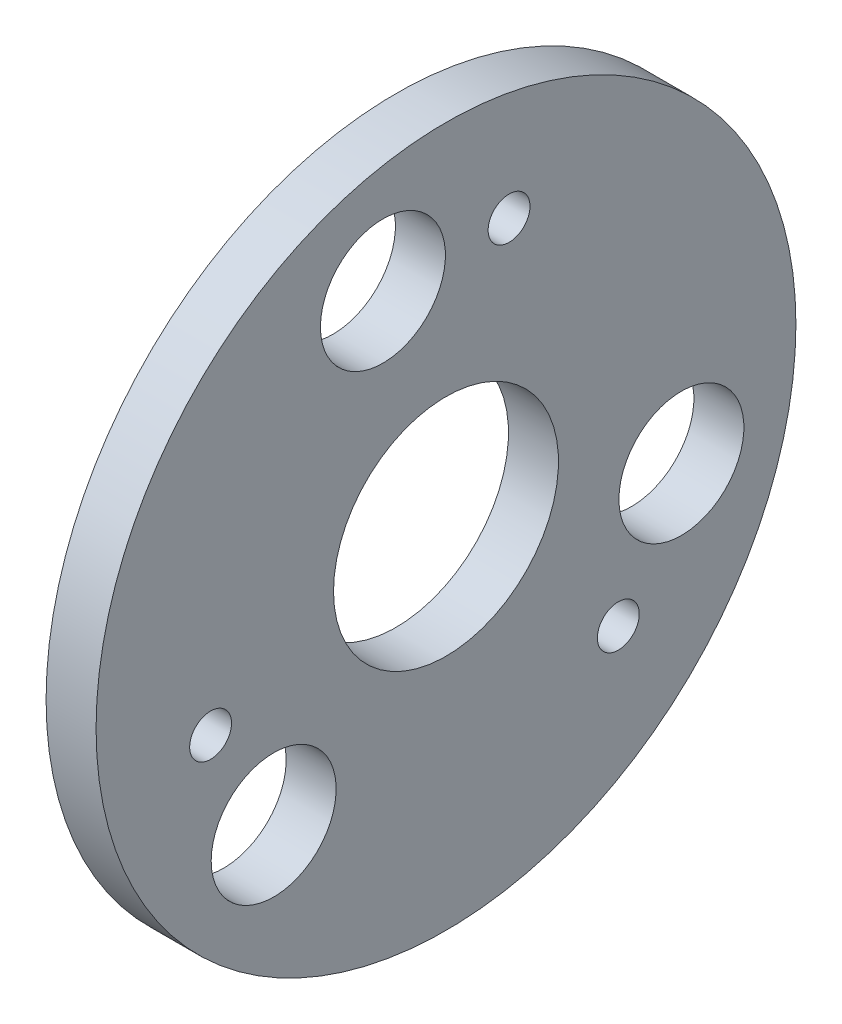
ISO-10303-21;
HEADER;
FILE_DESCRIPTION(('STEP AP214'),'2;1');
FILE_NAME('part.step','',(''),(''),'','','');
FILE_SCHEMA(('AUTOMOTIVE_DESIGN { 1 0 10303 214 1 1 1 1 }'));
ENDSEC;
DATA;
#1=APPLICATION_CONTEXT('core data for automotive mechanical design processes');
#2=APPLICATION_PROTOCOL_DEFINITION('international standard','automotive_design',2000,#1);
#3=PRODUCT_CONTEXT('',#1,'mechanical');
#4=PRODUCT('Part','Part','',(#3));
#5=PRODUCT_RELATED_PRODUCT_CATEGORY('part','',(#4));
#6=PRODUCT_DEFINITION_FORMATION('','',#4);
#7=PRODUCT_DEFINITION_CONTEXT('part definition',#1,'design');
#8=PRODUCT_DEFINITION('design','',#6,#7);
#9=PRODUCT_DEFINITION_SHAPE('','',#8);
#10=(LENGTH_UNIT() NAMED_UNIT(*) SI_UNIT(.MILLI.,.METRE.));
#11=(NAMED_UNIT(*) PLANE_ANGLE_UNIT() SI_UNIT($,.RADIAN.));
#12=(NAMED_UNIT(*) SI_UNIT($,.STERADIAN.) SOLID_ANGLE_UNIT());
#13=UNCERTAINTY_MEASURE_WITH_UNIT(LENGTH_MEASURE(1.E-05),#10,'distance_accuracy_value','');
#14=(GEOMETRIC_REPRESENTATION_CONTEXT(3) GLOBAL_UNCERTAINTY_ASSIGNED_CONTEXT((#13)) GLOBAL_UNIT_ASSIGNED_CONTEXT((#10,
#11,#12)) REPRESENTATION_CONTEXT('',''));
#15=CARTESIAN_POINT('',(0.,0.,0.));
#16=DIRECTION('',(0.,0.,1.));
#17=DIRECTION('',(1.,0.,0.));
#18=AXIS2_PLACEMENT_3D('',#15,#16,#17);
#19=CARTESIAN_POINT('',(-22.,15.,15.));
#20=DIRECTION('',(-1.,0.,0.));
#21=DIRECTION('',(0.,0.,1.));
#22=AXIS2_PLACEMENT_3D('',#19,#20,#21);
#23=PLANE('',#22);
#24=CARTESIAN_POINT('',(-22.,15.,15.));
#25=DIRECTION('',(1.,0.,0.));
#26=DIRECTION('',(0.,0.,-1.));
#27=AXIS2_PLACEMENT_3D('',#24,#25,#26);
#28=CIRCLE('',#27,14.);
#29=CARTESIAN_POINT('',(-22.,15.,0.999999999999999));
#30=VERTEX_POINT('',#29);
#31=EDGE_CURVE('E47',#30,#30,#28,.T.);
#32=ORIENTED_EDGE('',*,*,#31,.F.);
#33=EDGE_LOOP('',(#32));
#34=FACE_BOUND('',#33,.T.);
#35=CARTESIAN_POINT('',(-22.,15.,15.));
#36=DIRECTION('',(-1.,0.,0.));
#37=DIRECTION('',(0.,0.,1.));
#38=AXIS2_PLACEMENT_3D('',#35,#36,#37);
#39=CIRCLE('',#38,4.5);
#40=CARTESIAN_POINT('',(-22.,15.,19.5));
#41=VERTEX_POINT('',#40);
#42=EDGE_CURVE('E50',#41,#41,#39,.F.);
#43=ORIENTED_EDGE('',*,*,#42,.T.);
#44=EDGE_LOOP('',(#43));
#45=FACE_BOUND('',#44,.T.);
#46=CARTESIAN_POINT('',(-22.,8.1057088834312,8.10570888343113));
#47=DIRECTION('',(-1.,0.,0.));
#48=DIRECTION('',(0.,0.,1.));
#49=AXIS2_PLACEMENT_3D('',#46,#47,#48);
#50=CIRCLE('',#49,0.8376);
#51=CARTESIAN_POINT('',(-22.,8.1057088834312,8.94330888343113));
#52=VERTEX_POINT('',#51);
#53=EDGE_CURVE('E53',#52,#52,#50,.F.);
#54=ORIENTED_EDGE('',*,*,#53,.T.);
#55=EDGE_LOOP('',(#54));
#56=FACE_BOUND('',#55,.T.);
#57=CARTESIAN_POINT('',(-22.,12.4765143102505,5.58222319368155));
#58=DIRECTION('',(-1.,0.,0.));
#59=DIRECTION('',(0.,0.,1.));
#60=AXIS2_PLACEMENT_3D('',#57,#58,#59);
#61=CIRCLE('',#60,2.5);
#62=CARTESIAN_POINT('',(-22.,12.4765143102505,8.08222319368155));
#63=VERTEX_POINT('',#62);
#64=EDGE_CURVE('E56',#63,#63,#61,.F.);
#65=ORIENTED_EDGE('',*,*,#64,.T.);
#66=EDGE_LOOP('',(#65));
#67=FACE_BOUND('',#66,.T.);
#68=CARTESIAN_POINT('',(-22.,24.4177768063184,12.4765143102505));
#69=DIRECTION('',(-1.,0.,0.));
#70=DIRECTION('',(0.,0.,1.));
#71=AXIS2_PLACEMENT_3D('',#68,#69,#70);
#72=CIRCLE('',#71,0.8376);
#73=CARTESIAN_POINT('',(-22.,24.4177768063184,13.3141143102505));
#74=VERTEX_POINT('',#73);
#75=EDGE_CURVE('E59',#74,#74,#72,.F.);
#76=ORIENTED_EDGE('',*,*,#75,.T.);
#77=EDGE_LOOP('',(#76));
#78=FACE_BOUND('',#77,.T.);
#79=CARTESIAN_POINT('',(-22.,12.4765143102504,24.4177768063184));
#80=DIRECTION('',(-1.,0.,0.));
#81=DIRECTION('',(0.,0.,1.));
#82=AXIS2_PLACEMENT_3D('',#79,#80,#81);
#83=CIRCLE('',#82,0.8376);
#84=CARTESIAN_POINT('',(-22.,12.4765143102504,25.2553768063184));
#85=VERTEX_POINT('',#84);
#86=EDGE_CURVE('E62',#85,#85,#83,.F.);
#87=ORIENTED_EDGE('',*,*,#86,.T.);
#88=EDGE_LOOP('',(#87));
#89=FACE_BOUND('',#88,.T.);
#90=CARTESIAN_POINT('',(-22.,24.4177768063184,17.5234856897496));
#91=DIRECTION('',(-1.,0.,0.));
#92=DIRECTION('',(0.,0.,1.));
#93=AXIS2_PLACEMENT_3D('',#90,#91,#92);
#94=CIRCLE('',#93,2.5);
#95=CARTESIAN_POINT('',(-22.,24.4177768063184,20.0234856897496));
#96=VERTEX_POINT('',#95);
#97=EDGE_CURVE('E64',#96,#96,#94,.F.);
#98=ORIENTED_EDGE('',*,*,#97,.T.);
#99=EDGE_LOOP('',(#98));
#100=FACE_BOUND('',#99,.T.);
#101=CARTESIAN_POINT('',(-22.,8.10570888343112,21.8942911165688));
#102=DIRECTION('',(-1.,0.,0.));
#103=DIRECTION('',(0.,0.,1.));
#104=AXIS2_PLACEMENT_3D('',#101,#102,#103);
#105=CIRCLE('',#104,2.5);
#106=CARTESIAN_POINT('',(-22.,8.10570888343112,24.3942911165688));
#107=VERTEX_POINT('',#106);
#108=EDGE_CURVE('E18',#107,#107,#105,.F.);
#109=ORIENTED_EDGE('',*,*,#108,.T.);
#110=EDGE_LOOP('',(#109));
#111=FACE_BOUND('',#110,.T.);
#112=ADVANCED_FACE('F15',(#34,#45,#56,#67,#78,#89,#100,#111),#23,.T.);
#113=CARTESIAN_POINT('',(-20.,8.10570888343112,21.8942911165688));
#114=DIRECTION('',(-1.,0.,0.));
#115=DIRECTION('',(0.,0.,1.));
#116=AXIS2_PLACEMENT_3D('',#113,#114,#115);
#117=CYLINDRICAL_SURFACE('',#116,2.5);
#118=CARTESIAN_POINT('',(-20.,8.10570888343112,21.8942911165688));
#119=DIRECTION('',(-1.,0.,0.));
#120=DIRECTION('',(0.,0.,1.));
#121=AXIS2_PLACEMENT_3D('',#118,#119,#120);
#122=CIRCLE('',#121,2.5);
#123=CARTESIAN_POINT('',(-20.,8.10570888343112,24.3942911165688));
#124=VERTEX_POINT('',#123);
#125=EDGE_CURVE('E44',#124,#124,#122,.T.);
#126=ORIENTED_EDGE('',*,*,#125,.F.);
#127=EDGE_LOOP('',(#126));
#128=FACE_BOUND('',#127,.T.);
#129=ORIENTED_EDGE('',*,*,#108,.F.);
#130=EDGE_LOOP('',(#129));
#131=FACE_BOUND('',#130,.T.);
#132=ADVANCED_FACE('F72',(#128,#131),#117,.F.);
#133=CARTESIAN_POINT('',(-20.,24.4177768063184,17.5234856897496));
#134=DIRECTION('',(-1.,0.,0.));
#135=DIRECTION('',(0.,0.,1.));
#136=AXIS2_PLACEMENT_3D('',#133,#134,#135);
#137=CYLINDRICAL_SURFACE('',#136,2.5);
#138=CARTESIAN_POINT('',(-20.,24.4177768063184,17.5234856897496));
#139=DIRECTION('',(-1.,0.,0.));
#140=DIRECTION('',(0.,0.,1.));
#141=AXIS2_PLACEMENT_3D('',#138,#139,#140);
#142=CIRCLE('',#141,2.5);
#143=CARTESIAN_POINT('',(-20.,24.4177768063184,20.0234856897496));
#144=VERTEX_POINT('',#143);
#145=EDGE_CURVE('E41',#144,#144,#142,.T.);
#146=ORIENTED_EDGE('',*,*,#145,.F.);
#147=EDGE_LOOP('',(#146));
#148=FACE_BOUND('',#147,.T.);
#149=ORIENTED_EDGE('',*,*,#97,.F.);
#150=EDGE_LOOP('',(#149));
#151=FACE_BOUND('',#150,.T.);
#152=ADVANCED_FACE('F74',(#148,#151),#137,.F.);
#153=CARTESIAN_POINT('',(-20.,12.4765143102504,24.4177768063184));
#154=DIRECTION('',(-1.,0.,0.));
#155=DIRECTION('',(0.,0.,1.));
#156=AXIS2_PLACEMENT_3D('',#153,#154,#155);
#157=CYLINDRICAL_SURFACE('',#156,0.8376);
#158=CARTESIAN_POINT('',(-20.,12.4765143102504,24.4177768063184));
#159=DIRECTION('',(-1.,0.,0.));
#160=DIRECTION('',(0.,0.,1.));
#161=AXIS2_PLACEMENT_3D('',#158,#159,#160);
#162=CIRCLE('',#161,0.8376);
#163=CARTESIAN_POINT('',(-20.,12.4765143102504,25.2553768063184));
#164=VERTEX_POINT('',#163);
#165=EDGE_CURVE('E38',#164,#164,#162,.T.);
#166=ORIENTED_EDGE('',*,*,#165,.F.);
#167=EDGE_LOOP('',(#166));
#168=FACE_BOUND('',#167,.T.);
#169=ORIENTED_EDGE('',*,*,#86,.F.);
#170=EDGE_LOOP('',(#169));
#171=FACE_BOUND('',#170,.T.);
#172=ADVANCED_FACE('F81',(#168,#171),#157,.F.);
#173=CARTESIAN_POINT('',(-20.,24.4177768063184,12.4765143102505));
#174=DIRECTION('',(-1.,0.,0.));
#175=DIRECTION('',(0.,0.,1.));
#176=AXIS2_PLACEMENT_3D('',#173,#174,#175);
#177=CYLINDRICAL_SURFACE('',#176,0.8376);
#178=CARTESIAN_POINT('',(-20.,24.4177768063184,12.4765143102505));
#179=DIRECTION('',(-1.,0.,0.));
#180=DIRECTION('',(0.,0.,1.));
#181=AXIS2_PLACEMENT_3D('',#178,#179,#180);
#182=CIRCLE('',#181,0.8376);
#183=CARTESIAN_POINT('',(-20.,24.4177768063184,13.3141143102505));
#184=VERTEX_POINT('',#183);
#185=EDGE_CURVE('E35',#184,#184,#182,.T.);
#186=ORIENTED_EDGE('',*,*,#185,.F.);
#187=EDGE_LOOP('',(#186));
#188=FACE_BOUND('',#187,.T.);
#189=ORIENTED_EDGE('',*,*,#75,.F.);
#190=EDGE_LOOP('',(#189));
#191=FACE_BOUND('',#190,.T.);
#192=ADVANCED_FACE('F108',(#188,#191),#177,.F.);
#193=CARTESIAN_POINT('',(-20.,12.4765143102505,5.58222319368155));
#194=DIRECTION('',(-1.,0.,0.));
#195=DIRECTION('',(0.,0.,1.));
#196=AXIS2_PLACEMENT_3D('',#193,#194,#195);
#197=CYLINDRICAL_SURFACE('',#196,2.5);
#198=CARTESIAN_POINT('',(-20.,12.4765143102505,5.58222319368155));
#199=DIRECTION('',(-1.,0.,0.));
#200=DIRECTION('',(0.,0.,1.));
#201=AXIS2_PLACEMENT_3D('',#198,#199,#200);
#202=CIRCLE('',#201,2.5);
#203=CARTESIAN_POINT('',(-20.,12.4765143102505,8.08222319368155));
#204=VERTEX_POINT('',#203);
#205=EDGE_CURVE('E32',#204,#204,#202,.T.);
#206=ORIENTED_EDGE('',*,*,#205,.F.);
#207=EDGE_LOOP('',(#206));
#208=FACE_BOUND('',#207,.T.);
#209=ORIENTED_EDGE('',*,*,#64,.F.);
#210=EDGE_LOOP('',(#209));
#211=FACE_BOUND('',#210,.T.);
#212=ADVANCED_FACE('F104',(#208,#211),#197,.F.);
#213=CARTESIAN_POINT('',(-20.,8.1057088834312,8.10570888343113));
#214=DIRECTION('',(-1.,0.,0.));
#215=DIRECTION('',(0.,0.,1.));
#216=AXIS2_PLACEMENT_3D('',#213,#214,#215);
#217=CYLINDRICAL_SURFACE('',#216,0.8376);
#218=CARTESIAN_POINT('',(-20.,8.1057088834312,8.10570888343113));
#219=DIRECTION('',(-1.,0.,0.));
#220=DIRECTION('',(0.,0.,1.));
#221=AXIS2_PLACEMENT_3D('',#218,#219,#220);
#222=CIRCLE('',#221,0.8376);
#223=CARTESIAN_POINT('',(-20.,8.1057088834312,8.94330888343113));
#224=VERTEX_POINT('',#223);
#225=EDGE_CURVE('E27',#224,#224,#222,.T.);
#226=ORIENTED_EDGE('',*,*,#225,.F.);
#227=EDGE_LOOP('',(#226));
#228=FACE_BOUND('',#227,.T.);
#229=ORIENTED_EDGE('',*,*,#53,.F.);
#230=EDGE_LOOP('',(#229));
#231=FACE_BOUND('',#230,.T.);
#232=ADVANCED_FACE('F100',(#228,#231),#217,.F.);
#233=CARTESIAN_POINT('',(-20.,15.,15.));
#234=DIRECTION('',(-1.,0.,0.));
#235=DIRECTION('',(0.,0.,1.));
#236=AXIS2_PLACEMENT_3D('',#233,#234,#235);
#237=CYLINDRICAL_SURFACE('',#236,4.5);
#238=CARTESIAN_POINT('',(-20.,15.,15.));
#239=DIRECTION('',(-1.,0.,0.));
#240=DIRECTION('',(0.,0.,1.));
#241=AXIS2_PLACEMENT_3D('',#238,#239,#240);
#242=CIRCLE('',#241,4.5);
#243=CARTESIAN_POINT('',(-20.,15.,19.5));
#244=VERTEX_POINT('',#243);
#245=EDGE_CURVE('E22',#244,#244,#242,.T.);
#246=ORIENTED_EDGE('',*,*,#245,.F.);
#247=EDGE_LOOP('',(#246));
#248=FACE_BOUND('',#247,.T.);
#249=ORIENTED_EDGE('',*,*,#42,.F.);
#250=EDGE_LOOP('',(#249));
#251=FACE_BOUND('',#250,.T.);
#252=ADVANCED_FACE('F93',(#248,#251),#237,.F.);
#253=CARTESIAN_POINT('',(-22.,15.,15.));
#254=DIRECTION('',(1.,0.,0.));
#255=DIRECTION('',(0.,0.,-1.));
#256=AXIS2_PLACEMENT_3D('',#253,#254,#255);
#257=CYLINDRICAL_SURFACE('',#256,14.);
#258=ORIENTED_EDGE('',*,*,#31,.T.);
#259=EDGE_LOOP('',(#258));
#260=FACE_BOUND('',#259,.T.);
#261=CARTESIAN_POINT('',(-20.,15.,15.));
#262=DIRECTION('',(1.,0.,0.));
#263=DIRECTION('',(0.,0.,-1.));
#264=AXIS2_PLACEMENT_3D('',#261,#262,#263);
#265=CIRCLE('',#264,14.);
#266=CARTESIAN_POINT('',(-20.,15.,0.999999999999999));
#267=VERTEX_POINT('',#266);
#268=EDGE_CURVE('E10',#267,#267,#265,.T.);
#269=ORIENTED_EDGE('',*,*,#268,.F.);
#270=EDGE_LOOP('',(#269));
#271=FACE_BOUND('',#270,.T.);
#272=ADVANCED_FACE('F88',(#260,#271),#257,.T.);
#273=CARTESIAN_POINT('',(-20.,15.,15.));
#274=DIRECTION('',(1.,0.,0.));
#275=DIRECTION('',(0.,0.,-1.));
#276=AXIS2_PLACEMENT_3D('',#273,#274,#275);
#277=PLANE('',#276);
#278=ORIENTED_EDGE('',*,*,#268,.T.);
#279=EDGE_LOOP('',(#278));
#280=FACE_BOUND('',#279,.T.);
#281=ORIENTED_EDGE('',*,*,#245,.T.);
#282=EDGE_LOOP('',(#281));
#283=FACE_BOUND('',#282,.T.);
#284=ORIENTED_EDGE('',*,*,#225,.T.);
#285=EDGE_LOOP('',(#284));
#286=FACE_BOUND('',#285,.T.);
#287=ORIENTED_EDGE('',*,*,#205,.T.);
#288=EDGE_LOOP('',(#287));
#289=FACE_BOUND('',#288,.T.);
#290=ORIENTED_EDGE('',*,*,#185,.T.);
#291=EDGE_LOOP('',(#290));
#292=FACE_BOUND('',#291,.T.);
#293=ORIENTED_EDGE('',*,*,#165,.T.);
#294=EDGE_LOOP('',(#293));
#295=FACE_BOUND('',#294,.T.);
#296=ORIENTED_EDGE('',*,*,#145,.T.);
#297=EDGE_LOOP('',(#296));
#298=FACE_BOUND('',#297,.T.);
#299=ORIENTED_EDGE('',*,*,#125,.T.);
#300=EDGE_LOOP('',(#299));
#301=FACE_BOUND('',#300,.T.);
#302=ADVANCED_FACE('F86',(#280,#283,#286,#289,#292,#295,#298,#301),#277,.T.);
#303=CLOSED_SHELL('',(#112,#132,#152,#172,#192,#212,#232,#252,#272,#302));
#304=MANIFOLD_SOLID_BREP('B1',#303);
#305=ADVANCED_BREP_SHAPE_REPRESENTATION('',(#18,#304),#14);
#306=SHAPE_DEFINITION_REPRESENTATION(#9,#305);
ENDSEC;
END-ISO-10303-21;
